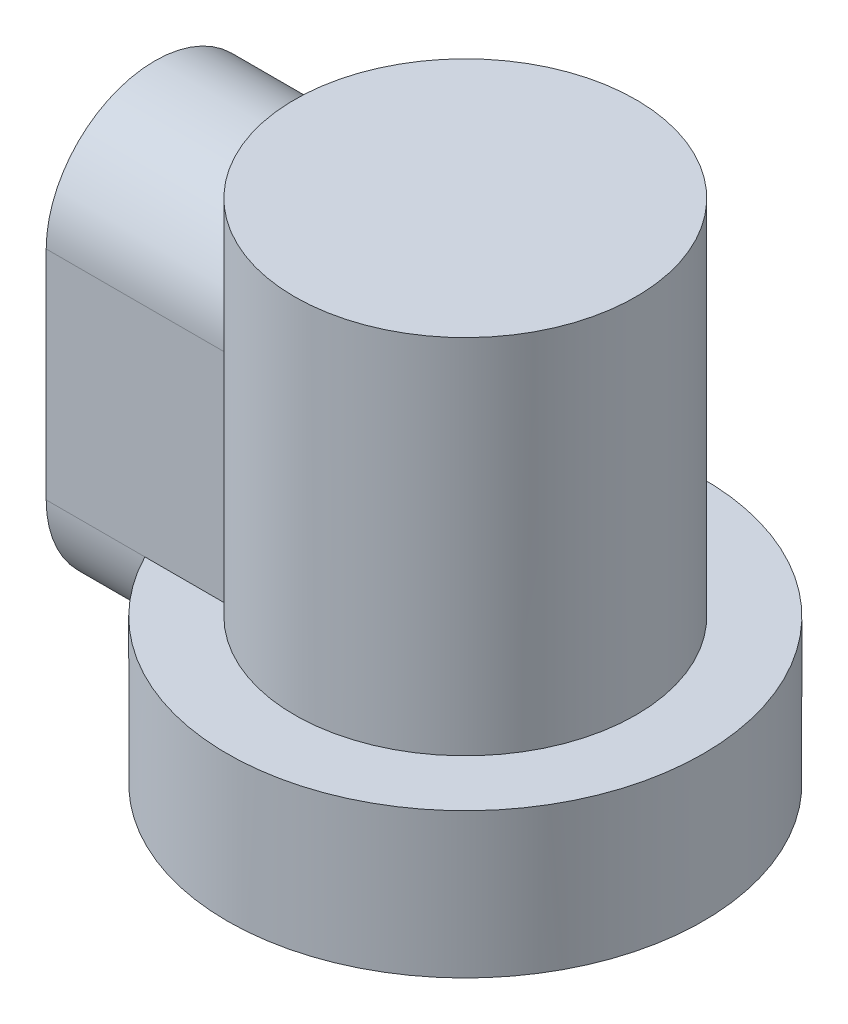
ISO-10303-21;
HEADER;
FILE_DESCRIPTION(('STEP AP214'),'2;1');
FILE_NAME('part.step','',(''),(''),'','','');
FILE_SCHEMA(('AUTOMOTIVE_DESIGN { 1 0 10303 214 1 1 1 1 }'));
ENDSEC;
DATA;
#1=APPLICATION_CONTEXT('core data for automotive mechanical design processes');
#2=APPLICATION_PROTOCOL_DEFINITION('international standard','automotive_design',2000,#1);
#3=PRODUCT_CONTEXT('',#1,'mechanical');
#4=PRODUCT('Part','Part','',(#3));
#5=PRODUCT_RELATED_PRODUCT_CATEGORY('part','',(#4));
#6=PRODUCT_DEFINITION_FORMATION('','',#4);
#7=PRODUCT_DEFINITION_CONTEXT('part definition',#1,'design');
#8=PRODUCT_DEFINITION('design','',#6,#7);
#9=PRODUCT_DEFINITION_SHAPE('','',#8);
#10=(LENGTH_UNIT() NAMED_UNIT(*) SI_UNIT(.MILLI.,.METRE.));
#11=(NAMED_UNIT(*) PLANE_ANGLE_UNIT() SI_UNIT($,.RADIAN.));
#12=(NAMED_UNIT(*) SI_UNIT($,.STERADIAN.) SOLID_ANGLE_UNIT());
#13=UNCERTAINTY_MEASURE_WITH_UNIT(LENGTH_MEASURE(1.E-05),#10,'distance_accuracy_value','');
#14=(GEOMETRIC_REPRESENTATION_CONTEXT(3) GLOBAL_UNCERTAINTY_ASSIGNED_CONTEXT((#13)) GLOBAL_UNIT_ASSIGNED_CONTEXT((#10,
#11,#12)) REPRESENTATION_CONTEXT('',''));
#15=CARTESIAN_POINT('',(0.,0.,0.));
#16=DIRECTION('',(0.,0.,1.));
#17=DIRECTION('',(1.,0.,0.));
#18=AXIS2_PLACEMENT_3D('',#15,#16,#17);
#19=CARTESIAN_POINT('',(0.,56.,0.));
#20=DIRECTION('',(0.,1.,0.));
#21=DIRECTION('',(0.,0.,1.));
#22=AXIS2_PLACEMENT_3D('',#19,#20,#21);
#23=PLANE('',#22);
#24=DIRECTION('',(1.,0.,0.));
#25=VECTOR('',#24,1.);
#26=CARTESIAN_POINT('',(-120.,56.,-42.));
#27=LINE('',#26,#25);
#28=CARTESIAN_POINT('',(-81.8535277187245,56.,-42.));
#29=VERTEX_POINT('',#28);
#30=CARTESIAN_POINT('',(-50.9116882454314,56.,-42.));
#31=VERTEX_POINT('',#30);
#32=EDGE_CURVE('E111',#29,#31,#27,.T.);
#33=ORIENTED_EDGE('',*,*,#32,.T.);
#34=CARTESIAN_POINT('',(0.,56.,0.));
#35=DIRECTION('',(0.,1.,0.));
#36=DIRECTION('',(0.,0.,1.));
#37=AXIS2_PLACEMENT_3D('',#34,#35,#36);
#38=CIRCLE('',#37,66.);
#39=CARTESIAN_POINT('',(-50.9116882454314,56.,42.));
#40=VERTEX_POINT('',#39);
#41=EDGE_CURVE('E107',#40,#31,#38,.T.);
#42=ORIENTED_EDGE('',*,*,#41,.F.);
#43=DIRECTION('',(1.,0.,0.));
#44=VECTOR('',#43,1.);
#45=CARTESIAN_POINT('',(-120.,56.,42.));
#46=LINE('',#45,#44);
#47=CARTESIAN_POINT('',(-81.8535277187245,56.,42.));
#48=VERTEX_POINT('',#47);
#49=EDGE_CURVE('E50',#48,#40,#46,.T.);
#50=ORIENTED_EDGE('',*,*,#49,.F.);
#51=CARTESIAN_POINT('',(0.,56.,0.));
#52=DIRECTION('',(0.,1.,0.));
#53=DIRECTION('',(0.,0.,1.));
#54=AXIS2_PLACEMENT_3D('',#51,#52,#53);
#55=CIRCLE('',#54,92.);
#56=EDGE_CURVE('E120',#48,#29,#55,.T.);
#57=ORIENTED_EDGE('',*,*,#56,.T.);
#58=EDGE_LOOP('',(#33,#42,#50,#57));
#59=FACE_BOUND('',#58,.T.);
#60=ADVANCED_FACE('F30',(#59),#23,.T.);
#61=CARTESIAN_POINT('',(0.,56.,0.));
#62=DIRECTION('',(0.,-1.,0.));
#63=DIRECTION('',(0.,0.,-1.));
#64=AXIS2_PLACEMENT_3D('',#61,#62,#63);
#65=CYLINDRICAL_SURFACE('',#64,92.);
#66=ORIENTED_EDGE('',*,*,#56,.F.);
#67=CARTESIAN_POINT('',(-81.8535277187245,56.,42.));
#68=CARTESIAN_POINT('',(-81.8535097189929,55.4430841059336,42.000011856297));
#69=CARTESIAN_POINT('',(-81.8592110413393,54.8861769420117,41.9889232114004));
#70=CARTESIAN_POINT('',(-81.8819194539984,53.7734913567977,41.9446349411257));
#71=CARTESIAN_POINT('',(-81.8989261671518,53.2177128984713,41.9114360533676));
#72=CARTESIAN_POINT('',(-81.9441014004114,52.1086312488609,41.8230390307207));
#73=CARTESIAN_POINT('',(-81.9722644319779,51.5553269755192,41.7678517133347));
#74=CARTESIAN_POINT('',(-82.0394815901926,50.4520340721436,41.6356683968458));
#75=CARTESIAN_POINT('',(-82.0785357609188,49.9020454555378,41.55867230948));
#76=CARTESIAN_POINT('',(-82.2111118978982,48.2639784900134,41.2961521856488));
#77=CARTESIAN_POINT('',(-82.3202864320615,47.1820798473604,41.078636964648));
#78=CARTESIAN_POINT('',(-82.5767817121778,45.0431108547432,40.5605504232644));
#79=CARTESIAN_POINT('',(-82.7241058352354,43.986042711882,40.2599717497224));
#80=CARTESIAN_POINT('',(-83.0518631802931,41.905110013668,39.5794176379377));
#81=CARTESIAN_POINT('',(-83.232240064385,40.8811923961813,39.1995771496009));
#82=CARTESIAN_POINT('',(-83.6208395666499,38.8705490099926,38.3636217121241));
#83=CARTESIAN_POINT('',(-83.8290619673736,37.8838229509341,37.9075073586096));
#84=CARTESIAN_POINT('',(-84.2677902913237,35.951379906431,36.9219538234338));
#85=CARTESIAN_POINT('',(-84.4983223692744,35.0057129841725,36.3924282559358));
#86=CARTESIAN_POINT('',(-84.9754444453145,33.1609932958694,35.2639905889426));
#87=CARTESIAN_POINT('',(-85.2220351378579,32.2619425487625,34.6650754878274));
#88=CARTESIAN_POINT('',(-85.7422346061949,30.4553552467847,33.3586010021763));
#89=CARTESIAN_POINT('',(-86.016543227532,29.5513484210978,32.6464354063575));
#90=CARTESIAN_POINT('',(-86.5693118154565,27.8054693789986,31.1510773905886));
#91=CARTESIAN_POINT('',(-86.8477719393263,26.9635995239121,30.3678822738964));
#92=CARTESIAN_POINT('',(-87.4018152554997,25.3462116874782,28.7344134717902));
#93=CARTESIAN_POINT('',(-87.677397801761,24.5707083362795,27.8841250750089));
#94=CARTESIAN_POINT('',(-88.2187551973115,23.0906824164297,26.1209058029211));
#95=CARTESIAN_POINT('',(-88.4845298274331,22.3861614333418,25.2079735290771));
#96=CARTESIAN_POINT('',(-89.0136234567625,21.0164950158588,23.2730366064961));
#97=CARTESIAN_POINT('',(-89.2760299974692,20.3555482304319,22.2478025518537));
#98=CARTESIAN_POINT('',(-89.7752605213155,19.1229746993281,20.1389331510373));
#99=CARTESIAN_POINT('',(-90.0120833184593,18.5513520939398,19.0552951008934));
#100=CARTESIAN_POINT('',(-90.4532364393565,17.5030645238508,16.8371604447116));
#101=CARTESIAN_POINT('',(-90.6575800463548,17.0263607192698,15.7026848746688));
#102=CARTESIAN_POINT('',(-91.027792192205,16.1727859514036,13.3907080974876));
#103=CARTESIAN_POINT('',(-91.1936640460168,15.7959063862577,12.2132106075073));
#104=CARTESIAN_POINT('',(-91.4730365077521,15.1663010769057,9.89746248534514));
#105=CARTESIAN_POINT('',(-91.5891144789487,14.9074044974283,8.76119902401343));
#106=CARTESIAN_POINT('',(-91.7795891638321,14.4845966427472,6.46767238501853));
#107=CARTESIAN_POINT('',(-91.85398742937,14.3206818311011,5.31040999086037));
#108=CARTESIAN_POINT('',(-91.9589354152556,14.0899013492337,2.98473292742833));
#109=CARTESIAN_POINT('',(-91.9895026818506,14.0229968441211,1.81632290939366));
#110=CARTESIAN_POINT('',(-92.005946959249,13.9869710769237,-0.522293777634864));
#111=CARTESIAN_POINT('',(-91.991826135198,14.0178450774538,-1.69250035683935));
#112=CARTESIAN_POINT('',(-91.9219708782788,14.1711485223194,-3.93976565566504));
#113=CARTESIAN_POINT('',(-91.86934504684,14.2867396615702,-5.01739602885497));
#114=CARTESIAN_POINT('',(-91.727380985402,14.600338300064,-7.15807892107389));
#115=CARTESIAN_POINT('',(-91.638044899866,14.7983409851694,-8.22113228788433));
#116=CARTESIAN_POINT('',(-91.4248457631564,15.2747285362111,-10.3255132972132));
#117=CARTESIAN_POINT('',(-91.3009822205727,15.5531145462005,-11.3668406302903));
#118=CARTESIAN_POINT('',(-91.0216814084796,16.1875951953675,-13.4211872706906));
#119=CARTESIAN_POINT('',(-90.8662431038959,16.5436923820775,-14.4342056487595));
#120=CARTESIAN_POINT('',(-90.5248371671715,17.336373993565,-16.4409661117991));
#121=CARTESIAN_POINT('',(-90.3384455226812,17.7740884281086,-17.4341891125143));
#122=CARTESIAN_POINT('',(-89.9411331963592,18.7227559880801,-19.3798502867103));
#123=CARTESIAN_POINT('',(-89.7302124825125,19.2337092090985,-20.3322884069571));
#124=CARTESIAN_POINT('',(-89.2884883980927,20.3253129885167,-22.1918780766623));
#125=CARTESIAN_POINT('',(-89.057679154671,20.9059841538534,-23.0990161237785));
#126=CARTESIAN_POINT('',(-88.5812802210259,22.1331581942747,-24.8634703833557));
#127=CARTESIAN_POINT('',(-88.3356898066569,22.7796642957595,-25.7207841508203));
#128=CARTESIAN_POINT('',(-87.8144240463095,24.1906096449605,-27.4500951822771));
#129=CARTESIAN_POINT('',(-87.537933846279,24.9603731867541,-28.3175225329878));
#130=CARTESIAN_POINT('',(-87.120182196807,26.1659893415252,-29.5680113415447));
#131=CARTESIAN_POINT('',(-86.9804192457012,26.5763863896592,-29.9764251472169));
#132=CARTESIAN_POINT('',(-86.7007250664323,27.4137878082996,-30.7760242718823));
#133=CARTESIAN_POINT('',(-86.5607938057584,27.8407961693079,-31.1672054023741));
#134=CARTESIAN_POINT('',(-86.1420227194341,29.1461788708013,-32.3143100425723));
#135=CARTESIAN_POINT('',(-85.8643002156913,30.0486405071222,-33.0435144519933));
#136=CARTESIAN_POINT('',(-85.3193686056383,31.9128895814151,-34.4261196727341));
#137=CARTESIAN_POINT('',(-85.0521593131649,32.8746759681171,-35.0795218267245));
#138=CARTESIAN_POINT('',(-84.6588942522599,34.3810692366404,-36.0137885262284));
#139=CARTESIAN_POINT('',(-84.5262506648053,34.9060803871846,-36.323807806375));
#140=CARTESIAN_POINT('',(-84.2670082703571,35.9701520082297,-36.9212311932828));
#141=CARTESIAN_POINT('',(-84.1404080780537,36.5092092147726,-37.208640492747));
#142=CARTESIAN_POINT('',(-83.8942726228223,37.6007667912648,-37.7603269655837));
#143=CARTESIAN_POINT('',(-83.7747389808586,38.1532702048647,-38.0245988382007));
#144=CARTESIAN_POINT('',(-83.5438115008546,39.2707650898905,-38.5293211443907));
#145=CARTESIAN_POINT('',(-83.4324180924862,39.8357572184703,-38.7697703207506));
#146=CARTESIAN_POINT('',(-83.2189924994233,40.9762217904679,-39.2257894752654));
#147=CARTESIAN_POINT('',(-83.1169438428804,41.5516735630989,-39.4414034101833));
#148=CARTESIAN_POINT('',(-82.9229549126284,42.7130063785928,-39.8476375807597));
#149=CARTESIAN_POINT('',(-82.831014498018,43.2988872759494,-40.0382581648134));
#150=CARTESIAN_POINT('',(-82.6581819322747,44.4797557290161,-40.3938614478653));
#151=CARTESIAN_POINT('',(-82.5772857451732,45.0747398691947,-40.558853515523));
#152=CARTESIAN_POINT('',(-82.4273396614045,46.2727444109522,-40.8627258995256));
#153=CARTESIAN_POINT('',(-82.3582885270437,46.8757639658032,-41.0016089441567));
#154=CARTESIAN_POINT('',(-82.2233303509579,48.1796963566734,-41.2716625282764));
#155=CARTESIAN_POINT('',(-82.1594518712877,48.8817137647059,-41.3985444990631));
#156=CARTESIAN_POINT('',(-82.04926306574,50.2924505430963,-41.6165019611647));
#157=CARTESIAN_POINT('',(-82.0029479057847,51.001168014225,-41.707587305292));
#158=CARTESIAN_POINT('',(-81.9285457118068,52.4236002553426,-41.85356036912));
#159=CARTESIAN_POINT('',(-81.9004667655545,53.1373171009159,-41.9084320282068));
#160=CARTESIAN_POINT('',(-81.8629292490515,54.5673510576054,-41.9816754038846));
#161=CARTESIAN_POINT('',(-81.8534770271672,55.2836689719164,-42.0000346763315));
#162=CARTESIAN_POINT('',(-81.8535277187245,56.,-42.));
#163=B_SPLINE_CURVE_WITH_KNOTS('',3,(#67,#68,#69,#70,#71,#72,#73,#74,#75,#76,#77,#78,#79,#80,
#81,#82,#83,#84,#85,#86,#87,#88,#89,#90,#91,#92,#93,#94,#95,#96,#97,#98,#99,#100,#101,#102,#103,
#104,#105,#106,#107,#108,#109,#110,#111,#112,#113,#114,#115,#116,#117,#118,#119,#120,#121,#122,
#123,#124,#125,#126,#127,#128,#129,#130,#131,#132,#133,#134,#135,#136,#137,#138,#139,#140,#141,
#142,#143,#144,#145,#146,#147,#148,#149,#150,#151,#152,#153,#154,#155,#156,#157,#158,#159,#160,
#161,#162),.UNSPECIFIED.,.F.,.F.,(4,2,2,2,2,2,2,2,2,2,2,2,2,2,2,2,2,2,2,2,2,2,2,2,2,2,2,2,2,2,2,
2,2,2,2,2,2,2,2,2,2,2,2,2,2,2,2,4),(0.,1.67059238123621,3.34112903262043,5.0108448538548,
6.68056743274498,10.0028445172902,13.3254157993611,16.642375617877,19.9593095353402,
23.2801802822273,26.6011947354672,30.1465606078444,33.692061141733,37.2383412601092,
40.7847005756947,44.5231151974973,48.261703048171,51.998757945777,55.7354907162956,
59.2442913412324,62.7529613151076,66.260226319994,69.7673213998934,73.0187552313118,
76.269999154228,79.5212893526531,82.772686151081,86.0729854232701,89.3732890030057,
92.6745704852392,95.976013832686,99.5484214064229,101.334869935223,103.121750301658,
106.696709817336,110.271606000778,112.143021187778,114.014005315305,115.885416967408,
117.756927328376,119.625072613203,121.493191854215,123.360626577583,125.22786605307,
127.375449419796,129.522441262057,131.670384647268,133.819059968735),.UNSPECIFIED.);
#164=EDGE_CURVE('E11',#48,#29,#163,.T.);
#165=ORIENTED_EDGE('',*,*,#164,.T.);
#166=EDGE_LOOP('',(#66,#165));
#167=FACE_BOUND('',#166,.T.);
#168=CARTESIAN_POINT('',(0.,0.,0.));
#169=DIRECTION('',(0.,1.,0.));
#170=DIRECTION('',(0.,0.,1.));
#171=AXIS2_PLACEMENT_3D('',#168,#169,#170);
#172=CIRCLE('',#171,92.);
#173=CARTESIAN_POINT('',(0.,0.,92.));
#174=VERTEX_POINT('',#173);
#175=EDGE_CURVE('E117',#174,#174,#172,.T.);
#176=ORIENTED_EDGE('',*,*,#175,.T.);
#177=EDGE_LOOP('',(#176));
#178=FACE_BOUND('',#177,.T.);
#179=ADVANCED_FACE('F32',(#167,#178),#65,.T.);
#180=CARTESIAN_POINT('',(0.,0.,0.));
#181=DIRECTION('',(0.,1.,0.));
#182=DIRECTION('',(0.,0.,1.));
#183=AXIS2_PLACEMENT_3D('',#180,#181,#182);
#184=PLANE('',#183);
#185=ORIENTED_EDGE('',*,*,#175,.F.);
#186=EDGE_LOOP('',(#185));
#187=FACE_BOUND('',#186,.T.);
#188=ADVANCED_FACE('F147',(#187),#184,.F.);
#189=CARTESIAN_POINT('',(0.,196.,0.));
#190=DIRECTION('',(0.,-1.,0.));
#191=DIRECTION('',(0.,0.,-1.));
#192=AXIS2_PLACEMENT_3D('',#189,#190,#191);
#193=CYLINDRICAL_SURFACE('',#192,66.);
#194=CARTESIAN_POINT('',(0.,196.,0.));
#195=DIRECTION('',(0.,1.,0.));
#196=DIRECTION('',(0.,0.,1.));
#197=AXIS2_PLACEMENT_3D('',#194,#195,#196);
#198=CIRCLE('',#197,66.);
#199=CARTESIAN_POINT('',(0.,196.,66.));
#200=VERTEX_POINT('',#199);
#201=EDGE_CURVE('E114',#200,#200,#198,.T.);
#202=ORIENTED_EDGE('',*,*,#201,.F.);
#203=EDGE_LOOP('',(#202));
#204=FACE_BOUND('',#203,.T.);
#205=ORIENTED_EDGE('',*,*,#41,.T.);
#206=DIRECTION('',(0.,-1.,0.));
#207=VECTOR('',#206,1.);
#208=CARTESIAN_POINT('',(-50.9116882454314,196.,-42.));
#209=LINE('',#208,#207);
#210=CARTESIAN_POINT('',(-50.9116882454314,140.,-42.));
#211=VERTEX_POINT('',#210);
#212=EDGE_CURVE('E43',#31,#211,#209,.F.);
#213=ORIENTED_EDGE('',*,*,#212,.T.);
#214=CARTESIAN_POINT('',(-50.9116882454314,140.,-42.));
#215=CARTESIAN_POINT('',(-50.91168661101,140.519798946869,-42.0000010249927));
#216=CARTESIAN_POINT('',(-50.9196562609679,141.039577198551,-41.9903467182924));
#217=CARTESIAN_POINT('',(-50.9514347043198,142.07798185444,-41.9517811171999));
#218=CARTESIAN_POINT('',(-50.9752447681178,142.596608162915,-41.9228682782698));
#219=CARTESIAN_POINT('',(-51.0384343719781,143.631612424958,-41.8459162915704));
#220=CARTESIAN_POINT('',(-51.0778175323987,144.147989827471,-41.7978726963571));
#221=CARTESIAN_POINT('',(-51.1716842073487,145.177277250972,-41.6828999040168));
#222=CARTESIAN_POINT('',(-51.2261695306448,145.690186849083,-41.6159684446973));
#223=CARTESIAN_POINT('',(-51.4115953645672,147.223666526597,-41.3870411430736));
#224=CARTESIAN_POINT('',(-51.5644193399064,148.237613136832,-41.1970154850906));
#225=CARTESIAN_POINT('',(-51.9218808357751,150.239787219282,-40.7455599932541));
#226=CARTESIAN_POINT('',(-52.126516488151,151.228015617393,-40.4841327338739));
#227=CARTESIAN_POINT('',(-52.5778832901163,153.16483989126,-39.8961427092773));
#228=CARTESIAN_POINT('',(-52.8242244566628,154.113709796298,-39.5701790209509));
#229=CARTESIAN_POINT('',(-53.3523719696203,155.97731259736,-38.8551381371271));
#230=CARTESIAN_POINT('',(-53.6341836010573,156.892040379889,-38.4660515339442));
#231=CARTESIAN_POINT('',(-54.0775190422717,158.236147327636,-37.837649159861));
#232=CARTESIAN_POINT('',(-54.2287534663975,158.679570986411,-37.6206905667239));
#233=CARTESIAN_POINT('',(-54.53712840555,159.556760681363,-37.1722431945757));
#234=CARTESIAN_POINT('',(-54.6942673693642,159.99052920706,-36.9407582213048));
#235=CARTESIAN_POINT('',(-55.1732511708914,161.277258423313,-36.2248803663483));
#236=CARTESIAN_POINT('',(-55.5026524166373,162.115611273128,-35.7190792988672));
#237=CARTESIAN_POINT('',(-56.2214075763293,163.86565132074,-34.5784466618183));
#238=CARTESIAN_POINT('',(-56.6127071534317,164.771216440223,-33.9354612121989));
#239=CARTESIAN_POINT('',(-57.4025661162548,166.526761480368,-32.5815851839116));
#240=CARTESIAN_POINT('',(-57.8011259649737,167.376737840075,-31.8706902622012));
#241=CARTESIAN_POINT('',(-58.5968262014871,169.019035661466,-30.3829580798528));
#242=CARTESIAN_POINT('',(-58.993965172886,169.811309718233,-29.606067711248));
#243=CARTESIAN_POINT('',(-59.7780194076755,171.334289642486,-27.9892070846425));
#244=CARTESIAN_POINT('',(-60.1649340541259,172.064991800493,-27.14923303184));
#245=CARTESIAN_POINT('',(-60.9684187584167,173.549753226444,-25.2981248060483));
#246=CARTESIAN_POINT('',(-61.3825102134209,174.294983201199,-24.2788038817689));
#247=CARTESIAN_POINT('',(-62.1762138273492,175.696146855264,-22.167312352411));
#248=CARTESIAN_POINT('',(-62.5558223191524,176.352071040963,-21.0751340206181));
#249=CARTESIAN_POINT('',(-63.0909740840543,177.262998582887,-19.3875645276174));
#250=CARTESIAN_POINT('',(-63.2636161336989,177.554429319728,-18.8169457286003));
#251=CARTESIAN_POINT('',(-63.596277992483,178.112159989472,-17.6599957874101));
#252=CARTESIAN_POINT('',(-63.7562995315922,178.37846336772,-17.0736668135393));
#253=CARTESIAN_POINT('',(-64.0624678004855,178.884964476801,-15.8863501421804));
#254=CARTESIAN_POINT('',(-64.2086155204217,179.125164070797,-15.2853634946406));
#255=CARTESIAN_POINT('',(-64.4858671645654,179.578519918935,-14.0698766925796));
#256=CARTESIAN_POINT('',(-64.6169717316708,179.791677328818,-13.4553771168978));
#257=CARTESIAN_POINT('',(-64.8501805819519,180.169211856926,-12.2790517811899));
#258=CARTESIAN_POINT('',(-64.9538836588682,180.336358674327,-11.7184301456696));
#259=CARTESIAN_POINT('',(-65.1476185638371,180.64759578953,-10.5884997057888));
#260=CARTESIAN_POINT('',(-65.2376508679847,180.791686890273,-10.0191912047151));
#261=CARTESIAN_POINT('',(-65.4034000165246,181.056246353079,-8.87302475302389));
#262=CARTESIAN_POINT('',(-65.4791163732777,181.176713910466,-8.29616654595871));
#263=CARTESIAN_POINT('',(-65.6156600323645,181.393501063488,-7.13625384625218));
#264=CARTESIAN_POINT('',(-65.676489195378,181.489823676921,-6.55320013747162));
#265=CARTESIAN_POINT('',(-65.7827667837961,181.657852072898,-5.38262901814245));
#266=CARTESIAN_POINT('',(-65.8282272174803,181.729577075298,-4.79511546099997));
#267=CARTESIAN_POINT('',(-65.9034772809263,181.848182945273,-3.61666377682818));
#268=CARTESIAN_POINT('',(-65.9332689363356,181.89506702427,-3.0257261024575));
#269=CARTESIAN_POINT('',(-65.9769543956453,181.963784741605,-1.84181747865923));
#270=CARTESIAN_POINT('',(-65.9908487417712,181.985619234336,-1.24884659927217));
#271=CARTESIAN_POINT('',(-66.0026381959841,182.004145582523,-0.0624146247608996));
#272=CARTESIAN_POINT('',(-66.0005338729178,182.000838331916,0.531046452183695));
#273=CARTESIAN_POINT('',(-65.9730297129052,181.957614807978,2.14487396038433));
#274=CARTESIAN_POINT('',(-65.9319243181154,181.893017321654,3.16446164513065));
#275=CARTESIAN_POINT('',(-65.8032341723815,181.690186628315,5.19305098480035));
#276=CARTESIAN_POINT('',(-65.7156548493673,181.551962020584,6.20205386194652));
#277=CARTESIAN_POINT('',(-65.4960173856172,181.203720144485,8.20270470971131));
#278=CARTESIAN_POINT('',(-65.3639574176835,180.993699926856,9.19435196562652));
#279=CARTESIAN_POINT('',(-65.058244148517,180.504463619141,11.1538503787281));
#280=CARTESIAN_POINT('',(-64.8845890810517,180.225244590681,12.1217005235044));
#281=CARTESIAN_POINT('',(-64.4991478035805,179.600511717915,14.0287991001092));
#282=CARTESIAN_POINT('',(-64.2873305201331,179.254943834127,14.9680234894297));
#283=CARTESIAN_POINT('',(-63.8298325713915,178.501132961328,16.8123560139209));
#284=CARTESIAN_POINT('',(-63.5841523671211,178.092890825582,17.7174646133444));
#285=CARTESIAN_POINT('',(-63.0634501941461,177.217236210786,19.4898567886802));
#286=CARTESIAN_POINT('',(-62.7884256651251,176.749818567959,20.3571370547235));
#287=CARTESIAN_POINT('',(-62.2138509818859,175.759278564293,22.0507729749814));
#288=CARTESIAN_POINT('',(-61.914299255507,175.23615263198,22.8771260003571));
#289=CARTESIAN_POINT('',(-61.2564959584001,174.067874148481,24.5883042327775));
#290=CARTESIAN_POINT('',(-60.8956127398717,173.415656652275,25.4672993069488));
#291=CARTESIAN_POINT('',(-60.1563827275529,172.048727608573,27.1674268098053));
#292=CARTESIAN_POINT('',(-59.7780346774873,171.334011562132,27.9885550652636));
#293=CARTESIAN_POINT('',(-59.0109474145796,169.844597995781,29.5716545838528));
#294=CARTESIAN_POINT('',(-58.6221944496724,169.069818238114,30.3335417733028));
#295=CARTESIAN_POINT('',(-57.8427725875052,167.464140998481,31.7946438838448));
#296=CARTESIAN_POINT('',(-57.4521035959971,166.63324072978,32.4938556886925));
#297=CARTESIAN_POINT('',(-56.6239757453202,164.799852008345,33.9189389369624));
#298=CARTESIAN_POINT('',(-56.187468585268,163.789478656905,34.6352587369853));
#299=CARTESIAN_POINT('',(-55.3361996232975,161.702592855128,35.9796931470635));
#300=CARTESIAN_POINT('',(-54.9214421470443,160.626067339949,36.6077902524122));
#301=CARTESIAN_POINT('',(-54.128985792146,158.412321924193,37.7696536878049));
#302=CARTESIAN_POINT('',(-53.751233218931,157.275193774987,38.3035576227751));
#303=CARTESIAN_POINT('',(-53.0479806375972,154.943932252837,39.2717472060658));
#304=CARTESIAN_POINT('',(-52.7224576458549,153.749824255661,39.7060767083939));
#305=CARTESIAN_POINT('',(-52.2183841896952,151.640760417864,40.3653692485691));
#306=CARTESIAN_POINT('',(-52.0238698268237,150.737331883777,40.6152090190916));
#307=CARTESIAN_POINT('',(-51.6773415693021,148.908055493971,41.0552186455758));
#308=CARTESIAN_POINT('',(-51.5253207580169,147.982211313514,41.2453982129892));
#309=CARTESIAN_POINT('',(-51.2692145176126,146.114472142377,41.5633182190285));
#310=CARTESIAN_POINT('',(-51.1650691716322,145.172598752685,41.691136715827));
#311=CARTESIAN_POINT('',(-51.0083766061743,143.278023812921,41.882704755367));
#312=CARTESIAN_POINT('',(-50.9558300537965,142.325322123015,41.9464534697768));
#313=CARTESIAN_POINT('',(-50.9043777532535,140.413645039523,42.0088802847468));
#314=CARTESIAN_POINT('',(-50.9056227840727,139.454659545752,42.0073754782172));
#315=CARTESIAN_POINT('',(-50.9620766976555,137.540644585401,41.9388680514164));
#316=CARTESIAN_POINT('',(-51.0172858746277,136.585615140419,41.871865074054));
#317=CARTESIAN_POINT('',(-51.1795011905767,134.686081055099,41.6734323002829));
#318=CARTESIAN_POINT('',(-51.2865447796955,133.741584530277,41.5419559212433));
#319=CARTESIAN_POINT('',(-51.5483770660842,131.870185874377,41.2166016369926));
#320=CARTESIAN_POINT('',(-51.7031668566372,130.943284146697,41.0227223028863));
#321=CARTESIAN_POINT('',(-52.0507480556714,129.134985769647,40.5807408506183));
#322=CARTESIAN_POINT('',(-52.2425066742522,128.253030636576,40.3340959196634));
#323=CARTESIAN_POINT('',(-52.6606912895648,126.514431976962,39.78655720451));
#324=CARTESIAN_POINT('',(-52.8871214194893,125.657791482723,39.4856569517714));
#325=CARTESIAN_POINT('',(-53.2482936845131,124.39410584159,38.9956456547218));
#326=CARTESIAN_POINT('',(-53.372296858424,123.976348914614,38.8258305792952));
#327=CARTESIAN_POINT('',(-53.6267262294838,123.148266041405,38.4736458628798));
#328=CARTESIAN_POINT('',(-53.7571509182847,122.737938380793,38.2912791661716));
#329=CARTESIAN_POINT('',(-54.15704996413,121.518217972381,37.72568287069));
#330=CARTESIAN_POINT('',(-54.435136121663,120.72013341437,37.3239747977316));
#331=CARTESIAN_POINT('',(-55.0642297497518,119.004177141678,36.3910083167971));
#332=CARTESIAN_POINT('',(-55.4189175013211,118.09310561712,35.8497361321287));
#333=CARTESIAN_POINT('',(-56.1439943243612,116.318701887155,34.7031993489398));
#334=CARTESIAN_POINT('',(-56.5143848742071,115.455374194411,34.0979287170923));
#335=CARTESIAN_POINT('',(-57.262943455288,113.777703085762,32.8253075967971));
#336=CARTESIAN_POINT('',(-57.6411193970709,112.963413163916,32.1578912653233));
#337=CARTESIAN_POINT('',(-58.3970978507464,111.387077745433,30.7637436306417));
#338=CARTESIAN_POINT('',(-58.7749003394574,110.625035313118,30.0370088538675));
#339=CARTESIAN_POINT('',(-59.5885662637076,109.026620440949,28.3933909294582));
#340=CARTESIAN_POINT('',(-60.0229621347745,108.200728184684,27.4655385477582));
#341=CARTESIAN_POINT('',(-60.869758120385,106.629878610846,25.5339915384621));
#342=CARTESIAN_POINT('',(-61.2821546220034,105.884934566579,24.5302845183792));
#343=CARTESIAN_POINT('',(-62.0736013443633,104.48287079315,22.4522385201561));
#344=CARTESIAN_POINT('',(-62.4526811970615,103.825672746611,21.37796382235));
#345=CARTESIAN_POINT('',(-63.1673124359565,102.605428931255,19.1635852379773));
#346=CARTESIAN_POINT('',(-63.5028760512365,102.042356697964,18.0234999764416));
#347=CARTESIAN_POINT('',(-64.0586573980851,101.120466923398,15.9192993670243));
#348=CARTESIAN_POINT('',(-64.2885134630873,100.743330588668,14.9657158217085));
#349=CARTESIAN_POINT('',(-64.7094393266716,100.057731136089,13.0258574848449));
#350=CARTESIAN_POINT('',(-64.9005140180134,99.749259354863,12.0395868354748));
#351=CARTESIAN_POINT('',(-65.23964897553,99.2046918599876,10.0406753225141));
#352=CARTESIAN_POINT('',(-65.3877367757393,98.9685498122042,9.02805179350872));
#353=CARTESIAN_POINT('',(-65.63769087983,98.5713829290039,6.98248560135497));
#354=CARTESIAN_POINT('',(-65.7395562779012,98.4103595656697,5.94954254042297));
#355=CARTESIAN_POINT('',(-65.8948769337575,98.1652794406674,3.86758552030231));
#356=CARTESIAN_POINT('',(-65.9481778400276,98.0814680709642,2.8185310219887));
#357=CARTESIAN_POINT('',(-66.0044992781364,97.9929160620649,0.715730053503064));
#358=CARTESIAN_POINT('',(-66.0075198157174,97.9881754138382,-0.338016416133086));
#359=CARTESIAN_POINT('',(-65.9632043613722,98.0578369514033,-2.44190449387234));
#360=CARTESIAN_POINT('',(-65.9158639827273,98.1322460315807,-3.49204577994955));
#361=CARTESIAN_POINT('',(-65.7719886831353,98.3591284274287,-5.58041035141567));
#362=CARTESIAN_POINT('',(-65.67545484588,98.5116000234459,-6.61863389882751));
#363=CARTESIAN_POINT('',(-65.4414162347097,98.8831099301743,-8.62500951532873));
#364=CARTESIAN_POINT('',(-65.3061529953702,99.0985168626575,-9.59410094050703));
#365=CARTESIAN_POINT('',(-64.9960902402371,99.5954280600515,-11.5086336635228));
#366=CARTESIAN_POINT('',(-64.8212923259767,99.8769296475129,-12.4540759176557));
#367=CARTESIAN_POINT('',(-64.4356186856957,100.503041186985,-14.3162613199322));
#368=CARTESIAN_POINT('',(-64.2247408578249,100.847654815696,-15.2330027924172));
#369=CARTESIAN_POINT('',(-63.7708647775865,101.596719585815,-17.0334649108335));
#370=CARTESIAN_POINT('',(-63.5278647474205,102.001174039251,-17.9171837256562));
#371=CARTESIAN_POINT('',(-62.9940568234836,102.90024155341,-19.7153590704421));
#372=CARTESIAN_POINT('',(-62.7010009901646,103.399419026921,-20.6268651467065));
#373=CARTESIAN_POINT('',(-62.0882403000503,104.459367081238,-22.4038826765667));
#374=CARTESIAN_POINT('',(-61.7685343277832,105.020140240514,-23.2693922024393));
#375=CARTESIAN_POINT('',(-61.1081388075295,106.199944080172,-24.9522129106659));
#376=CARTESIAN_POINT('',(-60.7674350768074,106.819014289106,-25.7694907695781));
#377=CARTESIAN_POINT('',(-60.0713174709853,108.111760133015,-27.352970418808));
#378=CARTESIAN_POINT('',(-59.7159028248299,108.785438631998,-28.1191695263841));
#379=CARTESIAN_POINT('',(-58.942042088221,110.290705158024,-29.7108193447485));
#380=CARTESIAN_POINT('',(-58.5222136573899,111.130744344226,-30.5276244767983));
#381=CARTESIAN_POINT('',(-57.6813410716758,112.875808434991,-32.0881392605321));
#382=CARTESIAN_POINT('',(-57.2602967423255,113.780843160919,-32.8318378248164));
#383=CARTESIAN_POINT('',(-56.4275954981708,115.652993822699,-34.2432183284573));
#384=CARTESIAN_POINT('',(-56.015941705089,116.620130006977,-34.9108752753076));
#385=CARTESIAN_POINT('',(-55.2137888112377,118.613220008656,-36.1661748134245));
#386=CARTESIAN_POINT('',(-54.8232856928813,119.639162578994,-36.7538326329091));
#387=CARTESIAN_POINT('',(-54.130904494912,121.591821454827,-37.7645798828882));
#388=CARTESIAN_POINT('',(-53.8244351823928,122.510967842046,-38.1991627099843));
#389=CARTESIAN_POINT('',(-53.2443377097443,124.387338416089,-39.0036731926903));
#390=CARTESIAN_POINT('',(-52.9707099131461,125.344563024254,-39.3736001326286));
#391=CARTESIAN_POINT('',(-52.4655273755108,127.291224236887,-40.0442811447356));
#392=CARTESIAN_POINT('',(-52.2338776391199,128.280581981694,-40.3451918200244));
#393=CARTESIAN_POINT('',(-51.8203681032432,130.288457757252,-40.8749654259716));
#394=CARTESIAN_POINT('',(-51.6384893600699,131.306964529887,-41.1038557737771));
#395=CARTESIAN_POINT('',(-51.3918749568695,132.963656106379,-41.4113162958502));
#396=CARTESIAN_POINT('',(-51.309139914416,133.594873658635,-41.5136712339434));
#397=CARTESIAN_POINT('',(-51.166232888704,134.863807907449,-41.6896818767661));
#398=CARTESIAN_POINT('',(-51.1060579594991,135.501523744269,-41.7633413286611));
#399=CARTESIAN_POINT('',(-51.0093285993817,136.781470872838,-41.8814303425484));
#400=CARTESIAN_POINT('',(-50.9727755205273,137.423702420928,-41.9258582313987));
#401=CARTESIAN_POINT('',(-50.9239533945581,138.710632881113,-41.9851460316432));
#402=CARTESIAN_POINT('',(-50.9116902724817,139.355332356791,-41.9999987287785));
#403=CARTESIAN_POINT('',(-50.9116882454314,140.,-42.));
#404=B_SPLINE_CURVE_WITH_KNOTS('',3,(#214,#215,#216,#217,#218,#219,#220,#221,#222,#223,#224,
#225,#226,#227,#228,#229,#230,#231,#232,#233,#234,#235,#236,#237,#238,#239,#240,#241,#242,#243,
#244,#245,#246,#247,#248,#249,#250,#251,#252,#253,#254,#255,#256,#257,#258,#259,#260,#261,#262,
#263,#264,#265,#266,#267,#268,#269,#270,#271,#272,#273,#274,#275,#276,#277,#278,#279,#280,#281,
#282,#283,#284,#285,#286,#287,#288,#289,#290,#291,#292,#293,#294,#295,#296,#297,#298,#299,#300,
#301,#302,#303,#304,#305,#306,#307,#308,#309,#310,#311,#312,#313,#314,#315,#316,#317,#318,#319,
#320,#321,#322,#323,#324,#325,#326,#327,#328,#329,#330,#331,#332,#333,#334,#335,#336,#337,#338,
#339,#340,#341,#342,#343,#344,#345,#346,#347,#348,#349,#350,#351,#352,#353,#354,#355,#356,#357,
#358,#359,#360,#361,#362,#363,#364,#365,#366,#367,#368,#369,#370,#371,#372,#373,#374,#375,#376,
#377,#378,#379,#380,#381,#382,#383,#384,#385,#386,#387,#388,#389,#390,#391,#392,#393,#394,#395,
#396,#397,#398,#399,#400,#401,#402,#403),.UNSPECIFIED.,.T.,.F.,(4,2,2,2,2,2,2,2,2,2,2,2,2,2,2,2,
2,2,2,2,2,2,2,2,2,2,2,2,2,2,2,2,2,2,2,2,2,2,2,2,2,2,2,2,2,2,2,2,2,2,2,2,2,2,2,2,2,2,2,2,2,2,2,2,
2,2,2,2,2,2,2,2,2,2,2,2,2,2,2,2,2,2,2,2,2,2,2,2,2,2,2,2,2,2,4),(0.,1.5592097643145,
3.11854459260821,4.67824214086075,6.23812657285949,9.3620220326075,12.4858048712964,
15.5818458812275,18.6783487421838,20.22697621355,21.7751996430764,24.8717552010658,
28.4010057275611,31.9304821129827,35.4628261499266,38.9953828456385,42.9767952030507,
46.9586304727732,48.9487367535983,50.9385697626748,52.9282606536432,54.9178664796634,
56.699609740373,58.4812909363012,60.2630328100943,62.0445518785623,63.8246757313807,
65.6045693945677,67.3844023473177,69.1641720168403,72.2274547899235,75.2903798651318,
78.3534307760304,81.4166117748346,84.4822983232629,87.5479431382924,90.6138556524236,
93.6799648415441,97.1340051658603,100.588294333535,104.04739952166,107.506676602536,
111.441559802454,115.377222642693,119.30708746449,123.235218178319,126.104389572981,
128.973093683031,131.838197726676,134.703338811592,137.576511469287,140.449699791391,
143.324967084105,146.200300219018,149.004630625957,151.809295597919,153.212139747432,
154.61465594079,157.419840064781,160.769262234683,164.119000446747,167.472328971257,
170.825854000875,174.768859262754,178.712510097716,182.652617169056,186.59161456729,
189.741094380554,192.89017659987,196.037237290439,199.184359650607,202.341449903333,
205.498539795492,208.655904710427,211.813200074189,214.815651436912,217.817981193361,
220.820485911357,223.823156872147,227.05923414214,230.295446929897,233.533870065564,
236.77246315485,240.502380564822,244.232862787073,247.964567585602,251.695561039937,
254.878345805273,258.061165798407,261.236690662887,264.411005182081,266.344446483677,
268.277635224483,270.21093460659,272.144705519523),.UNSPECIFIED.);
#405=CARTESIAN_POINT('',(-50.9116882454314,140.,42.));
#406=VERTEX_POINT('',#405);
#407=EDGE_CURVE('E58',#211,#406,#404,.T.);
#408=ORIENTED_EDGE('',*,*,#407,.T.);
#409=DIRECTION('',(0.,-1.,0.));
#410=VECTOR('',#409,1.);
#411=CARTESIAN_POINT('',(-50.9116882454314,196.,42.));
#412=LINE('',#411,#410);
#413=EDGE_CURVE('E86',#406,#40,#412,.T.);
#414=ORIENTED_EDGE('',*,*,#413,.T.);
#415=EDGE_LOOP('',(#205,#213,#408,#414));
#416=FACE_BOUND('',#415,.T.);
#417=ADVANCED_FACE('F130',(#204,#416),#193,.T.);
#418=CARTESIAN_POINT('',(0.,196.,0.));
#419=DIRECTION('',(0.,1.,0.));
#420=DIRECTION('',(0.,0.,1.));
#421=AXIS2_PLACEMENT_3D('',#418,#419,#420);
#422=PLANE('',#421);
#423=ORIENTED_EDGE('',*,*,#201,.T.);
#424=EDGE_LOOP('',(#423));
#425=FACE_BOUND('',#424,.T.);
#426=ADVANCED_FACE('F139',(#425),#422,.T.);
#427=CARTESIAN_POINT('',(-120.,56.,0.));
#428=DIRECTION('',(1.,0.,0.));
#429=DIRECTION('',(0.,0.,-1.));
#430=AXIS2_PLACEMENT_3D('',#427,#428,#429);
#431=CYLINDRICAL_SURFACE('',#430,42.);
#432=ORIENTED_EDGE('',*,*,#164,.F.);
#433=CARTESIAN_POINT('',(-120.,56.,42.));
#434=VERTEX_POINT('',#433);
#435=EDGE_CURVE('E112',#434,#48,#46,.T.);
#436=ORIENTED_EDGE('',*,*,#435,.F.);
#437=CARTESIAN_POINT('',(-120.,56.,0.));
#438=DIRECTION('',(1.,0.,0.));
#439=DIRECTION('',(0.,0.,-1.));
#440=AXIS2_PLACEMENT_3D('',#437,#438,#439);
#441=CIRCLE('',#440,42.);
#442=CARTESIAN_POINT('',(-120.,56.,-42.));
#443=VERTEX_POINT('',#442);
#444=EDGE_CURVE('E98',#434,#443,#441,.T.);
#445=ORIENTED_EDGE('',*,*,#444,.T.);
#446=EDGE_CURVE('E108',#443,#29,#27,.T.);
#447=ORIENTED_EDGE('',*,*,#446,.T.);
#448=EDGE_LOOP('',(#432,#436,#445,#447));
#449=FACE_BOUND('',#448,.T.);
#450=ADVANCED_FACE('F138',(#449),#431,.T.);
#451=CARTESIAN_POINT('',(-120.,140.,0.));
#452=DIRECTION('',(1.,0.,0.));
#453=DIRECTION('',(0.,0.,-1.));
#454=AXIS2_PLACEMENT_3D('',#451,#452,#453);
#455=CYLINDRICAL_SURFACE('',#454,42.);
#456=ORIENTED_EDGE('',*,*,#407,.F.);
#457=DIRECTION('',(1.,0.,0.));
#458=VECTOR('',#457,1.);
#459=CARTESIAN_POINT('',(-120.,140.,-42.));
#460=LINE('',#459,#458);
#461=CARTESIAN_POINT('',(-120.,140.,-42.));
#462=VERTEX_POINT('',#461);
#463=EDGE_CURVE('E101',#462,#211,#460,.T.);
#464=ORIENTED_EDGE('',*,*,#463,.F.);
#465=CARTESIAN_POINT('',(-120.,140.,0.));
#466=DIRECTION('',(1.,0.,0.));
#467=DIRECTION('',(0.,0.,-1.));
#468=AXIS2_PLACEMENT_3D('',#465,#466,#467);
#469=CIRCLE('',#468,42.);
#470=CARTESIAN_POINT('',(-120.,140.,42.));
#471=VERTEX_POINT('',#470);
#472=EDGE_CURVE('E95',#462,#471,#469,.T.);
#473=ORIENTED_EDGE('',*,*,#472,.T.);
#474=DIRECTION('',(1.,0.,0.));
#475=VECTOR('',#474,1.);
#476=CARTESIAN_POINT('',(-120.,140.,42.));
#477=LINE('',#476,#475);
#478=EDGE_CURVE('E82',#471,#406,#477,.T.);
#479=ORIENTED_EDGE('',*,*,#478,.T.);
#480=EDGE_LOOP('',(#456,#464,#473,#479));
#481=FACE_BOUND('',#480,.T.);
#482=ADVANCED_FACE('F100',(#481),#455,.T.);
#483=CARTESIAN_POINT('',(-120.,140.,-42.));
#484=DIRECTION('',(0.,0.,-1.));
#485=DIRECTION('',(0.,1.,0.));
#486=AXIS2_PLACEMENT_3D('',#483,#484,#485);
#487=PLANE('',#486);
#488=ORIENTED_EDGE('',*,*,#212,.F.);
#489=ORIENTED_EDGE('',*,*,#32,.F.);
#490=ORIENTED_EDGE('',*,*,#446,.F.);
#491=DIRECTION('',(0.,1.,0.));
#492=VECTOR('',#491,1.);
#493=CARTESIAN_POINT('',(-120.,140.,-42.));
#494=LINE('',#493,#492);
#495=EDGE_CURVE('E88',#443,#462,#494,.T.);
#496=ORIENTED_EDGE('',*,*,#495,.T.);
#497=ORIENTED_EDGE('',*,*,#463,.T.);
#498=EDGE_LOOP('',(#488,#489,#490,#496,#497));
#499=FACE_BOUND('',#498,.T.);
#500=ADVANCED_FACE('F137',(#499),#487,.T.);
#501=CARTESIAN_POINT('',(-120.,140.,42.));
#502=DIRECTION('',(0.,0.,1.));
#503=DIRECTION('',(0.,-1.,0.));
#504=AXIS2_PLACEMENT_3D('',#501,#502,#503);
#505=PLANE('',#504);
#506=ORIENTED_EDGE('',*,*,#413,.F.);
#507=ORIENTED_EDGE('',*,*,#478,.F.);
#508=DIRECTION('',(0.,-1.,0.));
#509=VECTOR('',#508,1.);
#510=CARTESIAN_POINT('',(-120.,140.,42.));
#511=LINE('',#510,#509);
#512=EDGE_CURVE('E85',#471,#434,#511,.T.);
#513=ORIENTED_EDGE('',*,*,#512,.T.);
#514=ORIENTED_EDGE('',*,*,#435,.T.);
#515=ORIENTED_EDGE('',*,*,#49,.T.);
#516=EDGE_LOOP('',(#506,#507,#513,#514,#515));
#517=FACE_BOUND('',#516,.T.);
#518=ADVANCED_FACE('F84',(#517),#505,.T.);
#519=CARTESIAN_POINT('',(-120.,140.,0.));
#520=DIRECTION('',(1.,0.,0.));
#521=DIRECTION('',(0.,0.,-1.));
#522=AXIS2_PLACEMENT_3D('',#519,#520,#521);
#523=PLANE('',#522);
#524=ORIENTED_EDGE('',*,*,#472,.F.);
#525=ORIENTED_EDGE('',*,*,#495,.F.);
#526=ORIENTED_EDGE('',*,*,#444,.F.);
#527=ORIENTED_EDGE('',*,*,#512,.F.);
#528=EDGE_LOOP('',(#524,#525,#526,#527));
#529=FACE_BOUND('',#528,.T.);
#530=ADVANCED_FACE('F93',(#529),#523,.F.);
#531=CLOSED_SHELL('',(#60,#179,#188,#417,#426,#450,#482,#500,#518,#530));
#532=MANIFOLD_SOLID_BREP('B2',#531);
#533=ADVANCED_BREP_SHAPE_REPRESENTATION('',(#18,#532),#14);
#534=SHAPE_DEFINITION_REPRESENTATION(#9,#533);
ENDSEC;
END-ISO-10303-21;
